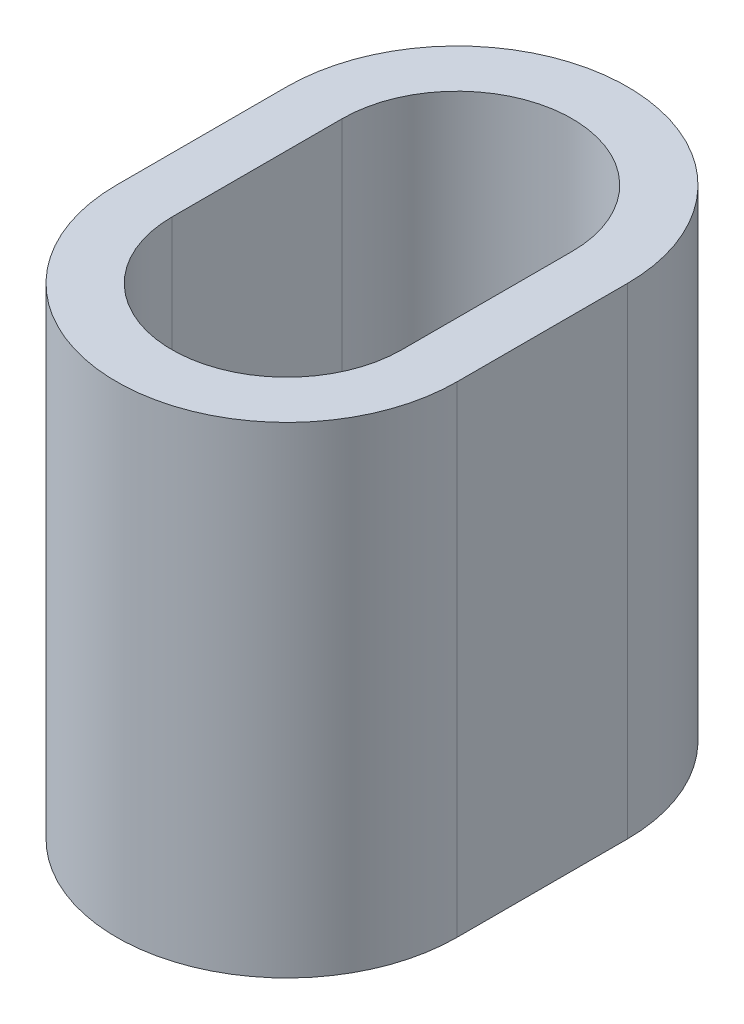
ISO-10303-21;
HEADER;
FILE_DESCRIPTION(('STEP AP214'),'2;1');
FILE_NAME('part.step','',(''),(''),'','','');
FILE_SCHEMA(('AUTOMOTIVE_DESIGN { 1 0 10303 214 1 1 1 1 }'));
ENDSEC;
DATA;
#1=APPLICATION_CONTEXT('core data for automotive mechanical design processes');
#2=APPLICATION_PROTOCOL_DEFINITION('international standard','automotive_design',2000,#1);
#3=PRODUCT_CONTEXT('',#1,'mechanical');
#4=PRODUCT('Part','Part','',(#3));
#5=PRODUCT_RELATED_PRODUCT_CATEGORY('part','',(#4));
#6=PRODUCT_DEFINITION_FORMATION('','',#4);
#7=PRODUCT_DEFINITION_CONTEXT('part definition',#1,'design');
#8=PRODUCT_DEFINITION('design','',#6,#7);
#9=PRODUCT_DEFINITION_SHAPE('','',#8);
#10=(LENGTH_UNIT() NAMED_UNIT(*) SI_UNIT(.MILLI.,.METRE.));
#11=(NAMED_UNIT(*) PLANE_ANGLE_UNIT() SI_UNIT($,.RADIAN.));
#12=(NAMED_UNIT(*) SI_UNIT($,.STERADIAN.) SOLID_ANGLE_UNIT());
#13=UNCERTAINTY_MEASURE_WITH_UNIT(LENGTH_MEASURE(1.E-05),#10,'distance_accuracy_value','');
#14=(GEOMETRIC_REPRESENTATION_CONTEXT(3) GLOBAL_UNCERTAINTY_ASSIGNED_CONTEXT((#13)) GLOBAL_UNIT_ASSIGNED_CONTEXT((#10,
#11,#12)) REPRESENTATION_CONTEXT('',''));
#15=CARTESIAN_POINT('',(0.,0.,0.));
#16=DIRECTION('',(0.,0.,1.));
#17=DIRECTION('',(1.,0.,0.));
#18=AXIS2_PLACEMENT_3D('',#15,#16,#17);
#19=CARTESIAN_POINT('',(0.,11.3000000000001,-2.00000000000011));
#20=DIRECTION('',(0.,-1.,0.));
#21=DIRECTION('',(1.,0.,0.));
#22=AXIS2_PLACEMENT_3D('',#19,#20,#21);
#23=CYLINDRICAL_SURFACE('',#22,4.);
#24=CARTESIAN_POINT('',(0.,0.,-2.00000000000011));
#25=DIRECTION('',(0.,-1.,0.));
#26=DIRECTION('',(1.,0.,0.));
#27=AXIS2_PLACEMENT_3D('',#24,#25,#26);
#28=CIRCLE('',#27,4.);
#29=CARTESIAN_POINT('',(-4.,0.,-2.00000000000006));
#30=VERTEX_POINT('',#29);
#31=CARTESIAN_POINT('',(4.,0.,-2.00000000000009));
#32=VERTEX_POINT('',#31);
#33=EDGE_CURVE('E129',#30,#32,#28,.T.);
#34=ORIENTED_EDGE('',*,*,#33,.F.);
#35=DIRECTION('',(0.,-1.,0.));
#36=VECTOR('',#35,1.);
#37=CARTESIAN_POINT('',(-4.,11.3000000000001,-2.00000000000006));
#38=LINE('',#37,#36);
#39=CARTESIAN_POINT('',(-4.,11.3000000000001,-2.00000000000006));
#40=VERTEX_POINT('',#39);
#41=EDGE_CURVE('E11',#40,#30,#38,.T.);
#42=ORIENTED_EDGE('',*,*,#41,.F.);
#43=CARTESIAN_POINT('',(0.,11.3000000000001,-2.00000000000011));
#44=DIRECTION('',(0.,-1.,0.));
#45=DIRECTION('',(1.,0.,0.));
#46=AXIS2_PLACEMENT_3D('',#43,#44,#45);
#47=CIRCLE('',#46,4.);
#48=CARTESIAN_POINT('',(4.,11.3000000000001,-2.00000000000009));
#49=VERTEX_POINT('',#48);
#50=EDGE_CURVE('E133',#40,#49,#47,.T.);
#51=ORIENTED_EDGE('',*,*,#50,.T.);
#52=DIRECTION('',(0.,-1.,0.));
#53=VECTOR('',#52,1.);
#54=CARTESIAN_POINT('',(4.,11.3000000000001,-2.00000000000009));
#55=LINE('',#54,#53);
#56=EDGE_CURVE('E34',#49,#32,#55,.T.);
#57=ORIENTED_EDGE('',*,*,#56,.T.);
#58=EDGE_LOOP('',(#34,#42,#51,#57));
#59=FACE_BOUND('',#58,.T.);
#60=ADVANCED_FACE('F31',(#59),#23,.T.);
#61=CARTESIAN_POINT('',(-4.,11.3000000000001,1.99999999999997));
#62=DIRECTION('',(-1.,0.,0.));
#63=DIRECTION('',(0.,0.,1.));
#64=AXIS2_PLACEMENT_3D('',#61,#62,#63);
#65=PLANE('',#64);
#66=DIRECTION('',(0.,0.,-1.));
#67=VECTOR('',#66,1.);
#68=CARTESIAN_POINT('',(-4.,0.,1.99999999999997));
#69=LINE('',#68,#67);
#70=CARTESIAN_POINT('',(-4.,0.,1.99999999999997));
#71=VERTEX_POINT('',#70);
#72=EDGE_CURVE('E137',#71,#30,#69,.T.);
#73=ORIENTED_EDGE('',*,*,#72,.F.);
#74=DIRECTION('',(0.,-1.,0.));
#75=VECTOR('',#74,1.);
#76=CARTESIAN_POINT('',(-4.,11.3000000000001,1.99999999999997));
#77=LINE('',#76,#75);
#78=CARTESIAN_POINT('',(-4.,11.3000000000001,1.99999999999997));
#79=VERTEX_POINT('',#78);
#80=EDGE_CURVE('E39',#79,#71,#77,.T.);
#81=ORIENTED_EDGE('',*,*,#80,.F.);
#82=DIRECTION('',(0.,0.,-1.));
#83=VECTOR('',#82,1.);
#84=CARTESIAN_POINT('',(-4.,11.3000000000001,1.99999999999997));
#85=LINE('',#84,#83);
#86=EDGE_CURVE('E143',#79,#40,#85,.T.);
#87=ORIENTED_EDGE('',*,*,#86,.T.);
#88=ORIENTED_EDGE('',*,*,#41,.T.);
#89=EDGE_LOOP('',(#73,#81,#87,#88));
#90=FACE_BOUND('',#89,.T.);
#91=ADVANCED_FACE('F169',(#90),#65,.T.);
#92=CARTESIAN_POINT('',(0.,11.3000000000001,1.99999999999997));
#93=DIRECTION('',(0.,-1.,0.));
#94=DIRECTION('',(1.,0.,0.));
#95=AXIS2_PLACEMENT_3D('',#92,#93,#94);
#96=CYLINDRICAL_SURFACE('',#95,4.);
#97=CARTESIAN_POINT('',(0.,0.,1.99999999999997));
#98=DIRECTION('',(0.,-1.,0.));
#99=DIRECTION('',(1.,0.,0.));
#100=AXIS2_PLACEMENT_3D('',#97,#98,#99);
#101=CIRCLE('',#100,4.);
#102=CARTESIAN_POINT('',(4.,0.,1.99999999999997));
#103=VERTEX_POINT('',#102);
#104=EDGE_CURVE('E151',#103,#71,#101,.T.);
#105=ORIENTED_EDGE('',*,*,#104,.F.);
#106=DIRECTION('',(0.,-1.,0.));
#107=VECTOR('',#106,1.);
#108=CARTESIAN_POINT('',(4.,11.3000000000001,1.99999999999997));
#109=LINE('',#108,#107);
#110=CARTESIAN_POINT('',(4.,11.3000000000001,1.99999999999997));
#111=VERTEX_POINT('',#110);
#112=EDGE_CURVE('E156',#111,#103,#109,.T.);
#113=ORIENTED_EDGE('',*,*,#112,.F.);
#114=CARTESIAN_POINT('',(0.,11.3000000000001,1.99999999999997));
#115=DIRECTION('',(0.,-1.,0.));
#116=DIRECTION('',(1.,0.,0.));
#117=AXIS2_PLACEMENT_3D('',#114,#115,#116);
#118=CIRCLE('',#117,4.);
#119=EDGE_CURVE('E140',#111,#79,#118,.T.);
#120=ORIENTED_EDGE('',*,*,#119,.T.);
#121=ORIENTED_EDGE('',*,*,#80,.T.);
#122=EDGE_LOOP('',(#105,#113,#120,#121));
#123=FACE_BOUND('',#122,.T.);
#124=ADVANCED_FACE('F173',(#123),#96,.T.);
#125=CARTESIAN_POINT('',(4.,11.3000000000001,-2.00000000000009));
#126=DIRECTION('',(1.,0.,0.));
#127=DIRECTION('',(0.,0.,-1.));
#128=AXIS2_PLACEMENT_3D('',#125,#126,#127);
#129=PLANE('',#128);
#130=DIRECTION('',(0.,0.,1.));
#131=VECTOR('',#130,1.);
#132=CARTESIAN_POINT('',(4.,0.,-2.00000000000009));
#133=LINE('',#132,#131);
#134=EDGE_CURVE('E148',#32,#103,#133,.T.);
#135=ORIENTED_EDGE('',*,*,#134,.F.);
#136=ORIENTED_EDGE('',*,*,#56,.F.);
#137=DIRECTION('',(0.,0.,1.));
#138=VECTOR('',#137,1.);
#139=CARTESIAN_POINT('',(4.,11.3000000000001,-2.00000000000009));
#140=LINE('',#139,#138);
#141=EDGE_CURVE('E136',#49,#111,#140,.T.);
#142=ORIENTED_EDGE('',*,*,#141,.T.);
#143=ORIENTED_EDGE('',*,*,#112,.T.);
#144=EDGE_LOOP('',(#135,#136,#142,#143));
#145=FACE_BOUND('',#144,.T.);
#146=ADVANCED_FACE('F164',(#145),#129,.T.);
#147=CARTESIAN_POINT('',(0.,11.3000000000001,-2.00000000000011));
#148=DIRECTION('',(0.,-1.,0.));
#149=DIRECTION('',(1.,0.,0.));
#150=AXIS2_PLACEMENT_3D('',#147,#148,#149);
#151=PLANE('',#150);
#152=DIRECTION('',(0.,0.,-1.));
#153=VECTOR('',#152,1.);
#154=CARTESIAN_POINT('',(-2.69999999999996,11.3000000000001,-2.00000000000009));
#155=LINE('',#154,#153);
#156=CARTESIAN_POINT('',(-2.69999999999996,11.3000000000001,1.99999999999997));
#157=VERTEX_POINT('',#156);
#158=CARTESIAN_POINT('',(-2.69999999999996,11.3000000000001,-2.00000000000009));
#159=VERTEX_POINT('',#158);
#160=EDGE_CURVE('E104',#157,#159,#155,.T.);
#161=ORIENTED_EDGE('',*,*,#160,.T.);
#162=CARTESIAN_POINT('',(0.,11.3000000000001,-2.00000000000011));
#163=DIRECTION('',(0.,-1.,0.));
#164=DIRECTION('',(-1.,0.,0.));
#165=AXIS2_PLACEMENT_3D('',#162,#163,#164);
#166=CIRCLE('',#165,2.69999999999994);
#167=CARTESIAN_POINT('',(2.69999999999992,11.3000000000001,-2.00000000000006));
#168=VERTEX_POINT('',#167);
#169=EDGE_CURVE('E98',#159,#168,#166,.T.);
#170=ORIENTED_EDGE('',*,*,#169,.T.);
#171=DIRECTION('',(0.,0.,1.));
#172=VECTOR('',#171,1.);
#173=CARTESIAN_POINT('',(2.69999999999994,11.3000000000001,1.99999999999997));
#174=LINE('',#173,#172);
#175=CARTESIAN_POINT('',(2.69999999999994,11.3000000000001,1.99999999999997));
#176=VERTEX_POINT('',#175);
#177=EDGE_CURVE('E107',#168,#176,#174,.T.);
#178=ORIENTED_EDGE('',*,*,#177,.T.);
#179=CARTESIAN_POINT('',(0.,11.3000000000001,1.99999999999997));
#180=DIRECTION('',(0.,-1.,0.));
#181=DIRECTION('',(-1.,0.,0.));
#182=AXIS2_PLACEMENT_3D('',#179,#180,#181);
#183=CIRCLE('',#182,2.69999999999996);
#184=EDGE_CURVE('E47',#176,#157,#183,.T.);
#185=ORIENTED_EDGE('',*,*,#184,.T.);
#186=EDGE_LOOP('',(#161,#170,#178,#185));
#187=FACE_BOUND('',#186,.T.);
#188=ORIENTED_EDGE('',*,*,#50,.F.);
#189=ORIENTED_EDGE('',*,*,#86,.F.);
#190=ORIENTED_EDGE('',*,*,#119,.F.);
#191=ORIENTED_EDGE('',*,*,#141,.F.);
#192=EDGE_LOOP('',(#188,#189,#190,#191));
#193=FACE_BOUND('',#192,.T.);
#194=ADVANCED_FACE('F111',(#187,#193),#151,.F.);
#195=CARTESIAN_POINT('',(0.,0.,-2.00000000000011));
#196=DIRECTION('',(0.,-1.,0.));
#197=DIRECTION('',(1.,0.,0.));
#198=AXIS2_PLACEMENT_3D('',#195,#196,#197);
#199=PLANE('',#198);
#200=CARTESIAN_POINT('',(0.,0.,-2.00000000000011));
#201=DIRECTION('',(0.,-1.,0.));
#202=DIRECTION('',(-1.,0.,0.));
#203=AXIS2_PLACEMENT_3D('',#200,#201,#202);
#204=CIRCLE('',#203,2.69999999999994);
#205=CARTESIAN_POINT('',(-2.69999999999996,0.,-2.00000000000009));
#206=VERTEX_POINT('',#205);
#207=CARTESIAN_POINT('',(2.69999999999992,0.,-2.00000000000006));
#208=VERTEX_POINT('',#207);
#209=EDGE_CURVE('E55',#206,#208,#204,.T.);
#210=ORIENTED_EDGE('',*,*,#209,.F.);
#211=DIRECTION('',(0.,0.,-1.));
#212=VECTOR('',#211,1.);
#213=CARTESIAN_POINT('',(-2.69999999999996,0.,-2.00000000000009));
#214=LINE('',#213,#212);
#215=CARTESIAN_POINT('',(-2.69999999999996,0.,1.99999999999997));
#216=VERTEX_POINT('',#215);
#217=EDGE_CURVE('E114',#216,#206,#214,.T.);
#218=ORIENTED_EDGE('',*,*,#217,.F.);
#219=CARTESIAN_POINT('',(0.,0.,1.99999999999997));
#220=DIRECTION('',(0.,-1.,0.));
#221=DIRECTION('',(-1.,0.,0.));
#222=AXIS2_PLACEMENT_3D('',#219,#220,#221);
#223=CIRCLE('',#222,2.69999999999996);
#224=CARTESIAN_POINT('',(2.69999999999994,0.,1.99999999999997));
#225=VERTEX_POINT('',#224);
#226=EDGE_CURVE('E117',#225,#216,#223,.T.);
#227=ORIENTED_EDGE('',*,*,#226,.F.);
#228=DIRECTION('',(0.,0.,1.));
#229=VECTOR('',#228,1.);
#230=CARTESIAN_POINT('',(2.69999999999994,0.,1.99999999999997));
#231=LINE('',#230,#229);
#232=EDGE_CURVE('E123',#208,#225,#231,.T.);
#233=ORIENTED_EDGE('',*,*,#232,.F.);
#234=EDGE_LOOP('',(#210,#218,#227,#233));
#235=FACE_BOUND('',#234,.T.);
#236=ORIENTED_EDGE('',*,*,#33,.T.);
#237=ORIENTED_EDGE('',*,*,#134,.T.);
#238=ORIENTED_EDGE('',*,*,#104,.T.);
#239=ORIENTED_EDGE('',*,*,#72,.T.);
#240=EDGE_LOOP('',(#236,#237,#238,#239));
#241=FACE_BOUND('',#240,.T.);
#242=ADVANCED_FACE('F166',(#235,#241),#199,.T.);
#243=CARTESIAN_POINT('',(0.,11.3000000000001,-2.00000000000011));
#244=DIRECTION('',(0.,-1.,0.));
#245=DIRECTION('',(1.,0.,0.));
#246=AXIS2_PLACEMENT_3D('',#243,#244,#245);
#247=CYLINDRICAL_SURFACE('',#246,2.69999999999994);
#248=ORIENTED_EDGE('',*,*,#209,.T.);
#249=DIRECTION('',(0.,-1.,0.));
#250=VECTOR('',#249,1.);
#251=CARTESIAN_POINT('',(2.69999999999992,11.3000000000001,-2.00000000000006));
#252=LINE('',#251,#250);
#253=EDGE_CURVE('E94',#168,#208,#252,.T.);
#254=ORIENTED_EDGE('',*,*,#253,.F.);
#255=ORIENTED_EDGE('',*,*,#169,.F.);
#256=DIRECTION('',(0.,-1.,0.));
#257=VECTOR('',#256,1.);
#258=CARTESIAN_POINT('',(-2.69999999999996,11.3000000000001,-2.00000000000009));
#259=LINE('',#258,#257);
#260=EDGE_CURVE('E127',#159,#206,#259,.T.);
#261=ORIENTED_EDGE('',*,*,#260,.T.);
#262=EDGE_LOOP('',(#248,#254,#255,#261));
#263=FACE_BOUND('',#262,.T.);
#264=ADVANCED_FACE('F96',(#263),#247,.F.);
#265=CARTESIAN_POINT('',(-2.69999999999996,11.3000000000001,-2.00000000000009));
#266=DIRECTION('',(-1.,0.,0.));
#267=DIRECTION('',(0.,0.,1.));
#268=AXIS2_PLACEMENT_3D('',#265,#266,#267);
#269=PLANE('',#268);
#270=ORIENTED_EDGE('',*,*,#217,.T.);
#271=ORIENTED_EDGE('',*,*,#260,.F.);
#272=ORIENTED_EDGE('',*,*,#160,.F.);
#273=DIRECTION('',(0.,-1.,0.));
#274=VECTOR('',#273,1.);
#275=CARTESIAN_POINT('',(-2.69999999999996,11.3000000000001,1.99999999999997));
#276=LINE('',#275,#274);
#277=EDGE_CURVE('E130',#157,#216,#276,.T.);
#278=ORIENTED_EDGE('',*,*,#277,.T.);
#279=EDGE_LOOP('',(#270,#271,#272,#278));
#280=FACE_BOUND('',#279,.T.);
#281=ADVANCED_FACE('F224',(#280),#269,.F.);
#282=CARTESIAN_POINT('',(0.,11.3000000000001,1.99999999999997));
#283=DIRECTION('',(0.,-1.,0.));
#284=DIRECTION('',(1.,0.,0.));
#285=AXIS2_PLACEMENT_3D('',#282,#283,#284);
#286=CYLINDRICAL_SURFACE('',#285,2.69999999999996);
#287=ORIENTED_EDGE('',*,*,#226,.T.);
#288=ORIENTED_EDGE('',*,*,#277,.F.);
#289=ORIENTED_EDGE('',*,*,#184,.F.);
#290=DIRECTION('',(0.,-1.,0.));
#291=VECTOR('',#290,1.);
#292=CARTESIAN_POINT('',(2.69999999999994,11.3000000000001,1.99999999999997));
#293=LINE('',#292,#291);
#294=EDGE_CURVE('E103',#176,#225,#293,.T.);
#295=ORIENTED_EDGE('',*,*,#294,.T.);
#296=EDGE_LOOP('',(#287,#288,#289,#295));
#297=FACE_BOUND('',#296,.T.);
#298=ADVANCED_FACE('F233',(#297),#286,.F.);
#299=CARTESIAN_POINT('',(2.69999999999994,11.3000000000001,1.99999999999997));
#300=DIRECTION('',(1.,0.,0.));
#301=DIRECTION('',(0.,0.,-1.));
#302=AXIS2_PLACEMENT_3D('',#299,#300,#301);
#303=PLANE('',#302);
#304=ORIENTED_EDGE('',*,*,#232,.T.);
#305=ORIENTED_EDGE('',*,*,#294,.F.);
#306=ORIENTED_EDGE('',*,*,#177,.F.);
#307=ORIENTED_EDGE('',*,*,#253,.T.);
#308=EDGE_LOOP('',(#304,#305,#306,#307));
#309=FACE_BOUND('',#308,.T.);
#310=ADVANCED_FACE('F108',(#309),#303,.F.);
#311=CLOSED_SHELL('',(#60,#91,#124,#146,#194,#242,#264,#281,#298,#310));
#312=MANIFOLD_SOLID_BREP('B2',#311);
#313=ADVANCED_BREP_SHAPE_REPRESENTATION('',(#18,#312),#14);
#314=SHAPE_DEFINITION_REPRESENTATION(#9,#313);
ENDSEC;
END-ISO-10303-21;
